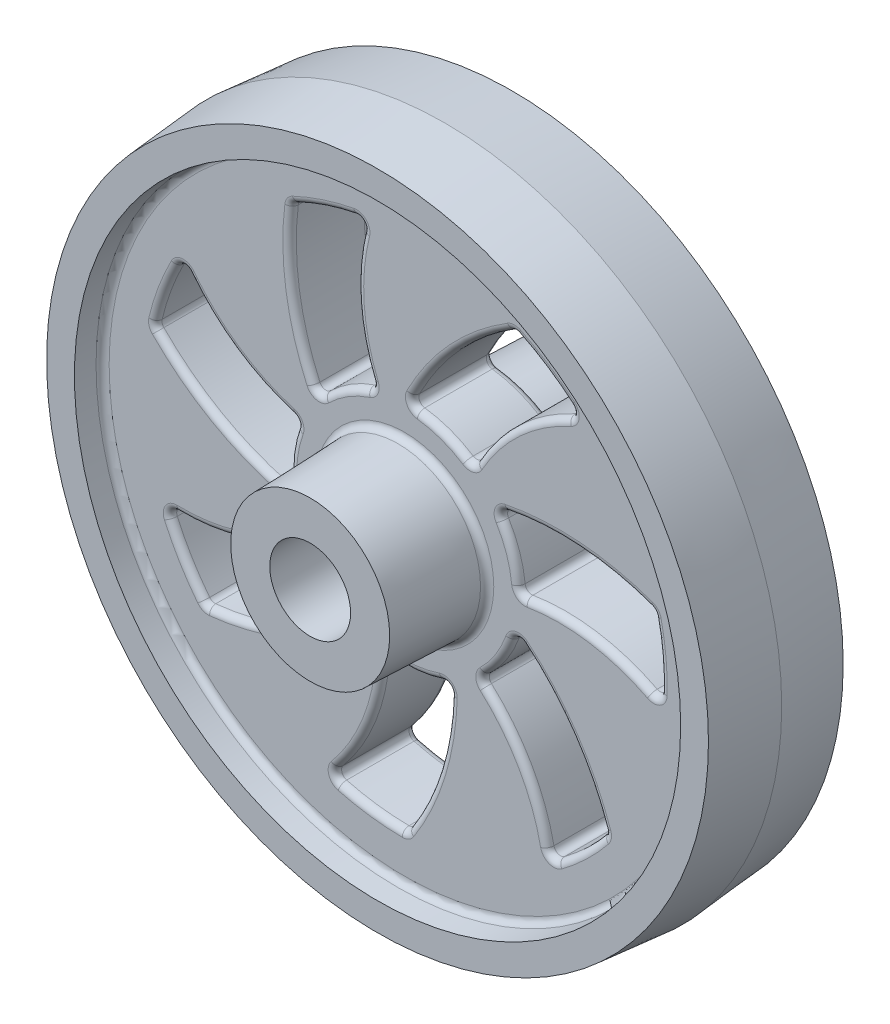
from build123d import *

# Parameters (mm, degrees)
SKETCH1_R                = 50
EXTRUDE1_DEPTH           = 10
EXTRUDE1_TAPER           = 5
EXTRUDE1_OTHER_WAY_DEPTH = 10
EXTRUDE1_OTHER_WAY_TAPER = 5
SKETCH7_R                = 45
CUT_EXTRUDE1_DEPTH       = 4
CUT_EXTRUDE1_DRAFT       = -3
MIRROR2_COPY_1_SKETCH_R  = 45
MIRROR2_COPY_1_DEPTH     = 4
MIRROR2_COPY_1_DRAFT     = -3
SKETCH2_R                = 12.5
EXTRUDE2_DEPTH           = 20
EXTRUDE2_TAPER           = 2
EXTRUDE2_OTHER_WAY_DEPTH = 20
EXTRUDE2_OTHER_WAY_TAPER = 2
EXTRUDE6_DEPTH           = 74.484692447
EXTRUDE6_DEPTH_BACK      = 74.484692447
SKETCH4_R                = 6
FILLET6_R                = 1
EXTRUDE3_DEPTH           = 74.484692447
FILLET1_R                = 1
CIRPATTERN1_COUNT        = 7
FILLET1_OF_CIRPATTERN1_R = 1


with BuildPart() as part:
    # Sketch1 → Extrude1 (new body)
    with BuildSketch(Plane.XY):
        Circle(SKETCH1_R)
    extrude(amount=EXTRUDE1_DEPTH, taper=EXTRUDE1_TAPER)

    # Sketch1 → Extrude1 other way (add)
    with BuildSketch(Plane.XY):
        Circle(SKETCH1_R)
    extrude(amount=-EXTRUDE1_OTHER_WAY_DEPTH, taper=EXTRUDE1_OTHER_WAY_TAPER)


with BuildPart() as cut_extrude1_tool:
    # Sketch7 → Cut-Extrude1 (with draft: the straight prism first)
    with BuildSketch(Plane.XY.offset(10)):
        Circle(SKETCH7_R)
    extrude(amount=-CUT_EXTRUDE1_DEPTH)
    # Cut-Extrude1: the draft: its side faces are tilted about the plane it starts from
    cut_extrude1_sides = [cut_extrude1_tool.faces().sort_by_distance(p)[0] for p in [
        (-45, 0, 8),
    ]]
    draft(cut_extrude1_sides, Plane.XY.offset(10), CUT_EXTRUDE1_DRAFT)


with BuildPart() as part_1:
    add(part.part)

    # Cut-Extrude1: cut by cut_extrude1_tool
    add(cut_extrude1_tool.part, mode=Mode.SUBTRACT)


with BuildPart() as mirror2_copy_1_tool:
    # Mirror2 copy 1 sketch → Mirror2 copy 1 (with draft: the straight prism first)
    with BuildSketch(Plane(origin=(0, 0, -10), x_dir=(1, 0, 0), z_dir=(0, 0, -1))):
        Circle(MIRROR2_COPY_1_SKETCH_R)
    extrude(amount=-MIRROR2_COPY_1_DEPTH)
    # Mirror2 copy 1: the draft: its side faces are tilted about the plane it starts from
    mirror2_copy_1_sides = [mirror2_copy_1_tool.faces().sort_by_distance(p)[0] for p in [
        (-45, 0, -8),
    ]]
    draft(mirror2_copy_1_sides, Plane(origin=(0, 0, -10), x_dir=(1, 0, 0), z_dir=(0, 0, -1)), MIRROR2_COPY_1_DRAFT)


with BuildPart() as part_2:
    add(part_1.part)

    # Mirror2 copy 1: cut by mirror2_copy_1_tool
    add(mirror2_copy_1_tool.part, mode=Mode.SUBTRACT)

    # Sketch2 → Extrude2 (add)
    with BuildSketch(Plane.XY):
        Circle(SKETCH2_R)
    extrude(amount=EXTRUDE2_DEPTH, taper=EXTRUDE2_TAPER)

    # Sketch2 → Extrude2 other way (add)
    with BuildSketch(Plane.XY):
        Circle(SKETCH2_R)
    extrude(amount=-EXTRUDE2_OTHER_WAY_DEPTH, taper=EXTRUDE2_OTHER_WAY_TAPER)

    # Sketch4 → Extrude6 (cut, two sides: drawn at the far end of the back side and taken through both)
    with BuildSketch(Plane.XY.offset(-EXTRUDE6_DEPTH_BACK)):
        Circle(SKETCH4_R)
    extrude(amount=EXTRUDE6_DEPTH + EXTRUDE6_DEPTH_BACK, mode=Mode.SUBTRACT)

    # Fillet6
    fillet6_edges = [part_2.edges().sort_by_distance(p)[0] for p in [
        (-44.790368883, 0, -6),
        (-12.290475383, 0, -6),
        (-12.290475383, 0, 6),
        (-44.790368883, 0, 6),
    ]]
    fillet(fillet6_edges, radius=FILLET6_R)

    # Sketch3 → Extrude3 (cut, symmetric)
    with BuildSketch(Plane.XY):
        with BuildLine():
            ThreePointArc((10.099224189, 13.675001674), (5.595059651, 16.052890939), (0.588659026, 16.989805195))
            ThreePointArc((0.588659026, 16.989805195), (7.138653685, 26.835324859), (16.281091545, 34.335492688))
            ThreePointArc((16.281091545, 34.335492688), (21.280531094, 31.482360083), (25.791656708, 27.906817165))
            ThreePointArc((25.791656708, 27.906817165), (16.647394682, 22.222174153), (10.099224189, 13.675001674))
        make_face()
    extrude3 = extrude(amount=EXTRUDE3_DEPTH, both=True, mode=Mode.SUBTRACT)

    # Fillet1
    fillet1_edges = [part_2.edges().sort_by_distance(p)[0] for p in [
        (21.280531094, 31.482360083, -6),
        (7.138653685, 26.835324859, -6),
        (5.595059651, 16.052890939, -6),
        (16.647394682, 22.222174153, -6),
        (16.647394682, 22.222174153, 6),
        (5.595059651, 16.052890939, 6),
        (7.138653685, 26.835324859, 6),
        (21.280531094, 31.482360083, 6),
        (25.791656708, 27.906817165, 0),
        (10.099224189, 13.675001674, 0),
        (0.588659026, 16.989805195, 0),
        (16.281091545, 34.335492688, 0),
    ]]
    fillet(fillet1_edges, radius=FILLET1_R)

    # CirPattern1: Extrude3 ×7 about axis
    cirpattern1_axis = Axis((0, 0, 0), (0, 0, 1))
    for i in range(1, CIRPATTERN1_COUNT):
        add(extrude3.rotate(cirpattern1_axis, i * 360 / CIRPATTERN1_COUNT), mode=Mode.SUBTRACT)

    # Fillet1 of CirPattern1
    fillet1_of_cirpattern1_edges = [part_2.edges().sort_by_distance(p)[0] for p in [
        (-11.34570614, 36.266719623, -6),
        (-16.529824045, 22.312775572, -6),
        (-9.062192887, 14.383207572, -6),
        (-6.99451455, 26.870756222, -6),
        (-6.99451455, 26.870756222, 6),
        (-9.062192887, 14.383207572, 6),
        (-16.529824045, 22.312775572, 6),
        (-11.34570614, 36.266719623, 6),
        (-5.737593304, 37.564345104, 0),
        (-4.394783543, 16.422115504, 0),
        (-12.916141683, 11.053202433, 0),
        (-16.693474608, 34.136899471, 0),
        (-35.42839524, 13.741499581, -6),
        (-27.751007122, 0.988251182, -6),
        (-16.895429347, 1.88267554, -6),
        (-25.369411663, 11.285110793, -6),
        (-25.369411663, 11.285110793, 6),
        (-16.895429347, 1.88267554, 6),
        (-27.751007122, 0.988251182, 6),
        (-35.42839524, 13.741499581, 6),
        (-32.946318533, 18.935155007, 0),
        (-15.57942963, 6.803041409, 0),
        (-16.694824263, -3.206687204, 0),
        (-37.097513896, 8.232524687, 0),
        (-32.832780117, -19.131349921, -6),
        (-18.075115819, -21.080446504, -6),
        (-12.006062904, -12.035549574, -6),
        (-24.640624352, -12.798453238, -6),
        (-24.640624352, -12.798453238, 6),
        (-12.006062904, -12.035549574, 6),
        (-18.075115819, -21.080446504, 6),
        (-32.832780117, -19.131349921, 6),
        (-35.345793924, -13.952593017, 0),
        (-15.032447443, -7.938861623, 0),
        (-7.901963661, -15.051875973, 0),
        (-29.566368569, -23.871109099, 0),
        (-5.513411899, -37.597902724, -6),
        (5.211706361, -27.275138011, -6),
        (1.924113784, -16.890760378, -6),
        (-5.356944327, -27.24452094, -6),
        (-5.356944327, -27.24452094, 6),
        (1.924113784, -16.890760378, 6),
        (5.211706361, -27.275138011, 6),
        (-5.513411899, -37.597902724, 6),
        (-11.129165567, -36.333753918, 0),
        (-3.165725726, -16.70263993, 0),
        (6.841236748, -15.562695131, 0),
        (0.228855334, -37.999310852, 0),
        (25.957667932, -27.752467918, -6),
        (24.574007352, -12.931094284, -6),
        (14.405393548, -9.026884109, -6),
        (17.960624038, -21.174908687, -6),
        (17.960624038, -21.174908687, 6),
        (14.405393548, -9.026884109, 6),
        (24.574007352, -12.931094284, 6),
        (25.957667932, -27.752467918, 6),
        (21.467951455, -31.354857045, 0),
        (11.084852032, -12.888989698, 0),
        (16.43284635, -4.354487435, 0),
        (29.851746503, -23.513256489, 0),
        (37.88209437, 2.991141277, -6),
        (25.431579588, 11.150327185, -6),
        (16.039118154, 5.634420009, -6),
        (27.753476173, 0.839841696, -6),
        (27.753476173, 0.839841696, 6),
        (16.039118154, 5.634420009, 6),
        (25.431579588, 11.150327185, 6),
        (37.88209437, 2.991141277, 6),
        (37.899263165, -2.765113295, 0),
        (16.98831012, 0.630332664, 0),
        (13.650187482, 10.132738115, 0),
        (36.995663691, 8.678759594, 0),
    ]]
    fillet(fillet1_of_cirpattern1_edges, radius=FILLET1_OF_CIRPATTERN1_R)


solid = part_2.part
